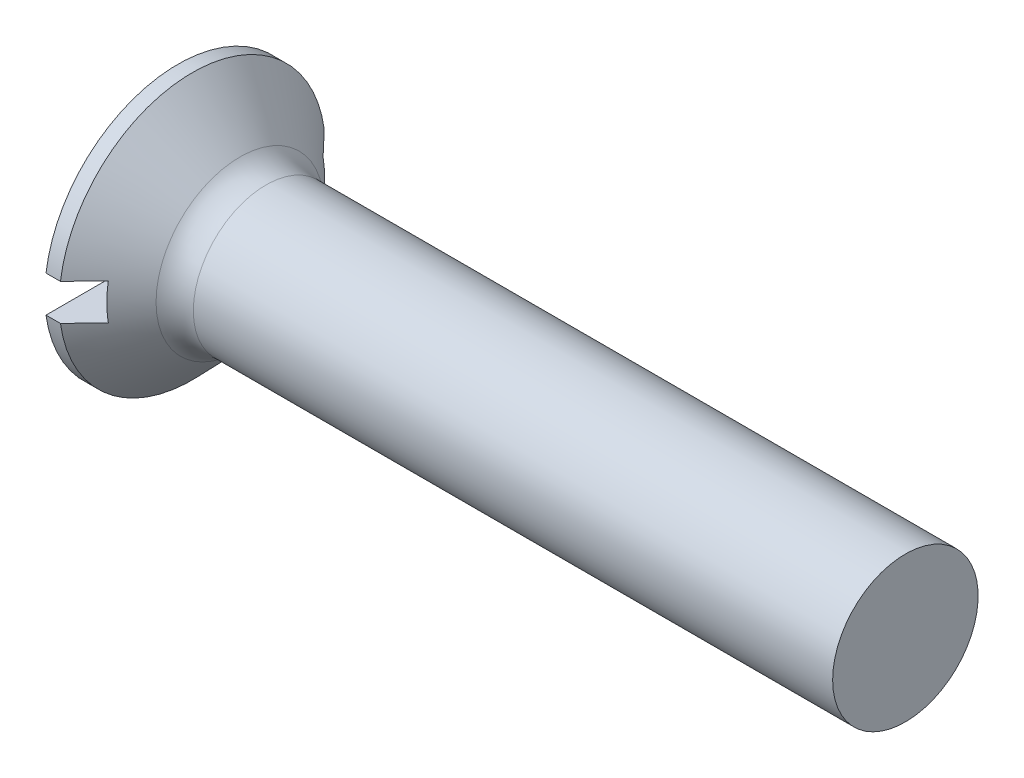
from build123d import *

# Parameters (mm, degrees)
FILLET1_R  = 2.5
SLOTSKE_W  = 18.3
SLOTSKE_H  = 2.5
SLOT_DEPTH = 2.6


with BuildPart() as part:
    # BodySke → BaseBody (revolve)
    with BuildSketch(Plane.XY, mode=Mode.PRIVATE) as basebody_sk:
        Polygon((0, 0), (0, 9.15), (0.992391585, 9.15), (5, 5), (50, 5), (50, 0), align=None)
    revolve(basebody_sk.sketch.rotate(Axis((0, 0, 0), (1, 0, 0)), 90), axis=Axis((0, 0, 0), (1, 0, 0)))

    # Fillet1
    fillet1_edges = [part.edges().sort_by_distance(p)[0] for p in [
        (5, 0, -5),
    ]]
    fillet(fillet1_edges, radius=FILLET1_R)

    # SlotSke → Slot (cut)
    with BuildSketch(Plane.ZY):
        Rectangle(SLOTSKE_W, SLOTSKE_H)
    extrude(amount=-SLOT_DEPTH, mode=Mode.SUBTRACT)


solid = part.part
